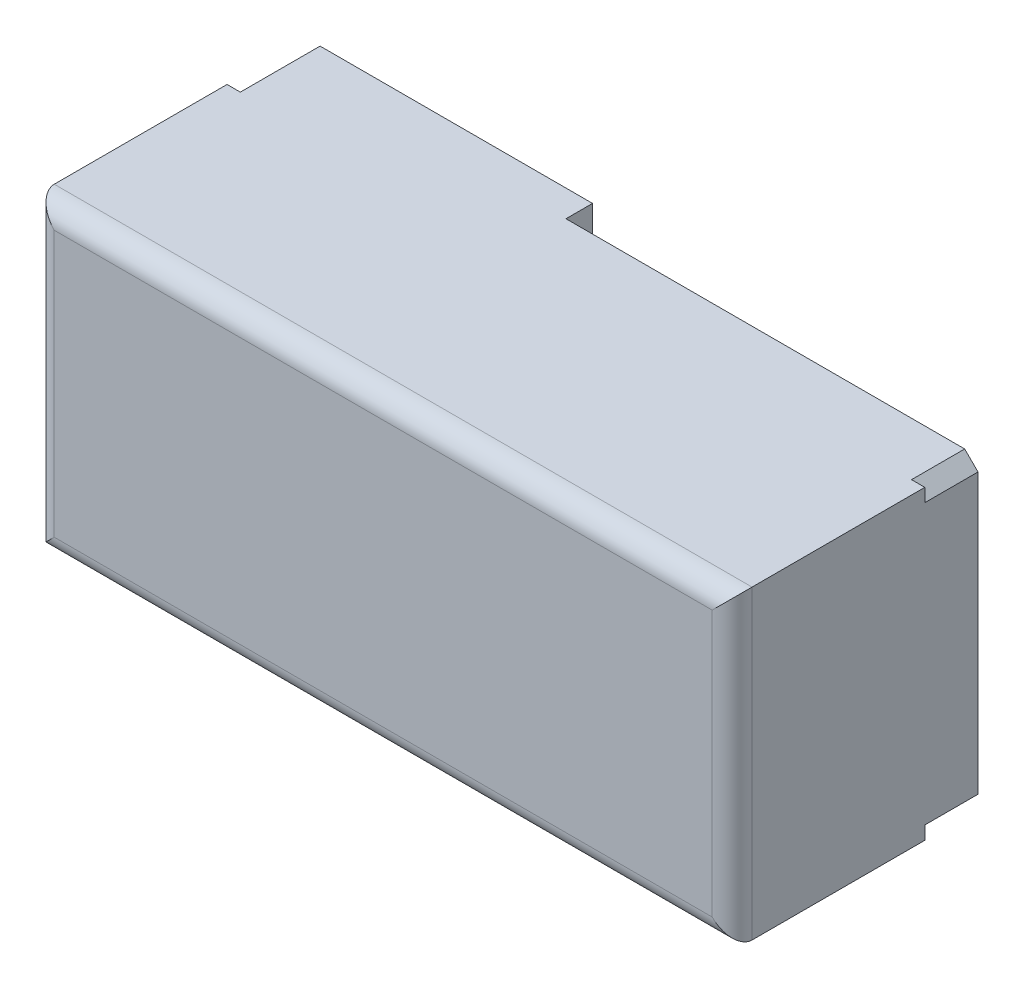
from build123d import *

# Parameters (mm, degrees)
SKETCH_1_W          = 105
SKETCH_1_H          = 46
EXTRUDE_1_DEPTH     = 12
SKETCH_2_R          = 8
CUT_EXTRUDE_1_DEPTH = 20
HOLE_WIZARD_M4_1_D  = 3.3
CHAMFER_2_SIZE      = 2
SKETCH_9_W          = 84.922493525
SKETCH_9_H          = 69.640450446
CUT_EXTRUDE_4_DEPTH = 4
SKETCH_10_W         = 105
SKETCH_10_H         = 46
EXTRUDE_2_DEPTH     = 29
FILLET_1_R          = 3


with BuildPart() as part:
    # Sketch 1 → Extrude 1 (new body)
    with BuildSketch(Plane.XY):
        Rectangle(SKETCH_1_W, SKETCH_1_H)
    extrude(amount=EXTRUDE_1_DEPTH)

    # Sketch 2 → Cut-Extrude 1 (cut)
    with BuildSketch(Plane.XY.offset(12)):
        with Locations((-31.5, 0)):
            Circle(SKETCH_2_R)
        with BuildLine():
            Line((22, 5), (32, 5))
            ThreePointArc((32, 5), (37, 0), (32, -5))
            Line((32, -5), (22, -5))
            ThreePointArc((22, -5), (17, 0), (22, 5))
        make_face()
    extrude(amount=-CUT_EXTRUDE_1_DEPTH, mode=Mode.SUBTRACT)

    # Hole Wizard M4 _1 (through all)
    with Locations(Plane(origin=(-14.5, 0, 12), x_dir=(1, 0, 0), z_dir=(0, 0, 1))):
        with Locations((0, 0), (58, 0)):
            Hole(HOLE_WIZARD_M4_1_D / 2)

    # Chamfer 2
    chamfer_2_edges = [part.edges().sort_by_distance(p)[0] for p in [
        (52.5, -23, 6),
        (-52.5, -23, 6),
        (-52.5, 23, 6),
        (52.5, 23, 6),
    ]]
    chamfer(chamfer_2_edges, length=CHAMFER_2_SIZE)

    # Sketch 9 → Cut-Extrude 4 (cut)
    with BuildSketch(Plane(origin=(0, 0, 0), x_dir=(-1, 0, 0), z_dir=(0, 0, -1))):
        with Locations((-32.961246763, 2.342451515)):
            Rectangle(SKETCH_9_W, SKETCH_9_H)
    extrude(amount=-CUT_EXTRUDE_4_DEPTH, mode=Mode.SUBTRACT)

    # Sketch 10 → Extrude 2 (add)
    with BuildSketch(Plane.XY.offset(12)):
        Rectangle(SKETCH_10_W, SKETCH_10_H)
    extrude(amount=EXTRUDE_2_DEPTH)

    # Fillet 1
    fillet_1_edges = [part.edges().sort_by_distance(p)[0] for p in [
        (0, -23, 41),
        (52.5, 0, 41),
        (0, 23, 41),
        (-52.5, 0, 41),
    ]]
    fillet(fillet_1_edges, radius=FILLET_1_R)


solid = part.part
